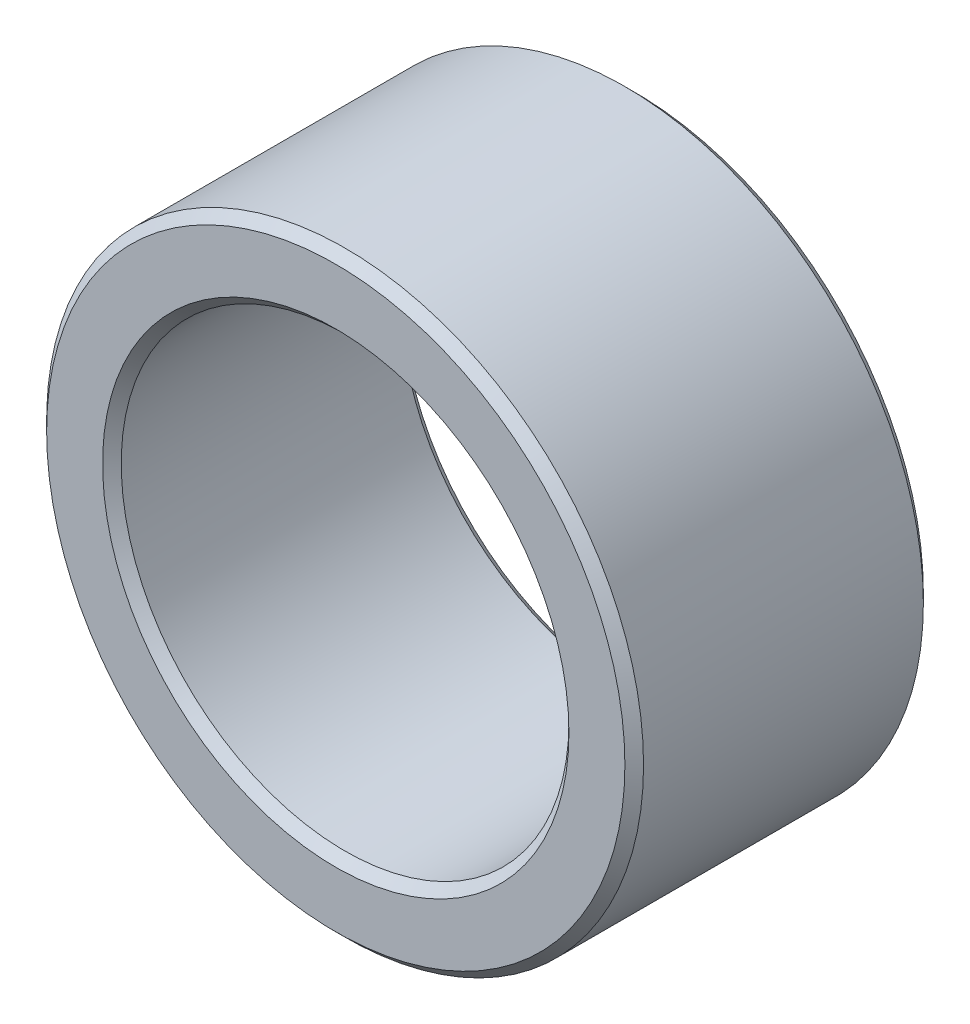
ISO-10303-21;
HEADER;
FILE_DESCRIPTION(('STEP AP214'),'2;1');
FILE_NAME('part.step','',(''),(''),'','','');
FILE_SCHEMA(('AUTOMOTIVE_DESIGN { 1 0 10303 214 1 1 1 1 }'));
ENDSEC;
DATA;
#1=APPLICATION_CONTEXT('core data for automotive mechanical design processes');
#2=APPLICATION_PROTOCOL_DEFINITION('international standard','automotive_design',2000,#1);
#3=PRODUCT_CONTEXT('',#1,'mechanical');
#4=PRODUCT('Part','Part','',(#3));
#5=PRODUCT_RELATED_PRODUCT_CATEGORY('part','',(#4));
#6=PRODUCT_DEFINITION_FORMATION('','',#4);
#7=PRODUCT_DEFINITION_CONTEXT('part definition',#1,'design');
#8=PRODUCT_DEFINITION('design','',#6,#7);
#9=PRODUCT_DEFINITION_SHAPE('','',#8);
#10=(LENGTH_UNIT() NAMED_UNIT(*) SI_UNIT(.MILLI.,.METRE.));
#11=(NAMED_UNIT(*) PLANE_ANGLE_UNIT() SI_UNIT($,.RADIAN.));
#12=(NAMED_UNIT(*) SI_UNIT($,.STERADIAN.) SOLID_ANGLE_UNIT());
#13=UNCERTAINTY_MEASURE_WITH_UNIT(LENGTH_MEASURE(1.E-05),#10,'distance_accuracy_value','');
#14=(GEOMETRIC_REPRESENTATION_CONTEXT(3) GLOBAL_UNCERTAINTY_ASSIGNED_CONTEXT((#13)) GLOBAL_UNIT_ASSIGNED_CONTEXT((#10,
#11,#12)) REPRESENTATION_CONTEXT('',''));
#15=CARTESIAN_POINT('',(0.,0.,0.));
#16=DIRECTION('',(0.,0.,1.));
#17=DIRECTION('',(1.,0.,0.));
#18=AXIS2_PLACEMENT_3D('',#15,#16,#17);
#19=CARTESIAN_POINT('',(0.,0.,16.));
#20=DIRECTION('',(0.,0.,1.));
#21=DIRECTION('',(1.,0.,0.));
#22=AXIS2_PLACEMENT_3D('',#19,#20,#21);
#23=PLANE('',#22);
#24=CARTESIAN_POINT('',(0.,0.,16.));
#25=DIRECTION('',(0.,0.,1.));
#26=DIRECTION('',(1.,0.,0.));
#27=AXIS2_PLACEMENT_3D('',#24,#25,#26);
#28=CIRCLE('',#27,12.5);
#29=CARTESIAN_POINT('',(12.5,0.,16.));
#30=VERTEX_POINT('',#29);
#31=EDGE_CURVE('E10',#30,#30,#28,.F.);
#32=ORIENTED_EDGE('',*,*,#31,.T.);
#33=EDGE_LOOP('',(#32));
#34=FACE_BOUND('',#33,.T.);
#35=CARTESIAN_POINT('',(0.,0.,16.));
#36=DIRECTION('',(0.,0.,1.));
#37=DIRECTION('',(1.,0.,0.));
#38=AXIS2_PLACEMENT_3D('',#35,#36,#37);
#39=CIRCLE('',#38,15.5);
#40=CARTESIAN_POINT('',(15.5,0.,16.));
#41=VERTEX_POINT('',#40);
#42=EDGE_CURVE('E35',#41,#41,#39,.T.);
#43=ORIENTED_EDGE('',*,*,#42,.T.);
#44=EDGE_LOOP('',(#43));
#45=FACE_BOUND('',#44,.T.);
#46=ADVANCED_FACE('F28',(#34,#45),#23,.T.);
#47=CARTESIAN_POINT('',(0.,0.,0.));
#48=DIRECTION('',(0.,0.,1.));
#49=DIRECTION('',(1.,0.,0.));
#50=AXIS2_PLACEMENT_3D('',#47,#48,#49);
#51=PLANE('',#50);
#52=CARTESIAN_POINT('',(0.,0.,0.));
#53=DIRECTION('',(0.,0.,1.));
#54=DIRECTION('',(1.,0.,0.));
#55=AXIS2_PLACEMENT_3D('',#52,#53,#54);
#56=CIRCLE('',#55,12.5);
#57=CARTESIAN_POINT('',(12.5,0.,0.));
#58=VERTEX_POINT('',#57);
#59=EDGE_CURVE('E54',#58,#58,#56,.T.);
#60=ORIENTED_EDGE('',*,*,#59,.T.);
#61=EDGE_LOOP('',(#60));
#62=FACE_BOUND('',#61,.T.);
#63=CARTESIAN_POINT('',(0.,0.,0.));
#64=DIRECTION('',(0.,0.,1.));
#65=DIRECTION('',(1.,0.,0.));
#66=AXIS2_PLACEMENT_3D('',#63,#64,#65);
#67=CIRCLE('',#66,15.5);
#68=CARTESIAN_POINT('',(15.5,0.,0.));
#69=VERTEX_POINT('',#68);
#70=EDGE_CURVE('E57',#69,#69,#67,.F.);
#71=ORIENTED_EDGE('',*,*,#70,.T.);
#72=EDGE_LOOP('',(#71));
#73=FACE_BOUND('',#72,.T.);
#74=ADVANCED_FACE('F61',(#62,#73),#51,.F.);
#75=CARTESIAN_POINT('',(0.,0.,16.));
#76=DIRECTION('',(0.,0.,-1.));
#77=DIRECTION('',(-1.,0.,0.));
#78=AXIS2_PLACEMENT_3D('',#75,#76,#77);
#79=CYLINDRICAL_SURFACE('',#78,16.);
#80=CARTESIAN_POINT('',(0.,0.,0.5));
#81=DIRECTION('',(0.,0.,1.));
#82=DIRECTION('',(1.,0.,0.));
#83=AXIS2_PLACEMENT_3D('',#80,#81,#82);
#84=CIRCLE('',#83,16.);
#85=CARTESIAN_POINT('',(16.,0.,0.5));
#86=VERTEX_POINT('',#85);
#87=EDGE_CURVE('E39',#86,#86,#84,.T.);
#88=ORIENTED_EDGE('',*,*,#87,.T.);
#89=EDGE_LOOP('',(#88));
#90=FACE_BOUND('',#89,.T.);
#91=CARTESIAN_POINT('',(0.,0.,15.5));
#92=DIRECTION('',(0.,0.,1.));
#93=DIRECTION('',(1.,0.,0.));
#94=AXIS2_PLACEMENT_3D('',#91,#92,#93);
#95=CIRCLE('',#94,16.);
#96=CARTESIAN_POINT('',(16.,0.,15.5));
#97=VERTEX_POINT('',#96);
#98=EDGE_CURVE('E43',#97,#97,#95,.F.);
#99=ORIENTED_EDGE('',*,*,#98,.T.);
#100=EDGE_LOOP('',(#99));
#101=FACE_BOUND('',#100,.T.);
#102=ADVANCED_FACE('F30',(#90,#101),#79,.T.);
#103=CARTESIAN_POINT('',(0.,0.,16.));
#104=DIRECTION('',(0.,0.,-1.));
#105=DIRECTION('',(-1.,0.,0.));
#106=AXIS2_PLACEMENT_3D('',#103,#104,#105);
#107=CYLINDRICAL_SURFACE('',#106,12.);
#108=CARTESIAN_POINT('',(0.,0.,0.500000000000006));
#109=DIRECTION('',(0.,0.,1.));
#110=DIRECTION('',(1.,0.,0.));
#111=AXIS2_PLACEMENT_3D('',#108,#109,#110);
#112=CIRCLE('',#111,12.);
#113=CARTESIAN_POINT('',(12.,0.,0.500000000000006));
#114=VERTEX_POINT('',#113);
#115=EDGE_CURVE('E48',#114,#114,#112,.F.);
#116=ORIENTED_EDGE('',*,*,#115,.T.);
#117=EDGE_LOOP('',(#116));
#118=FACE_BOUND('',#117,.T.);
#119=CARTESIAN_POINT('',(0.,0.,15.5));
#120=DIRECTION('',(0.,0.,1.));
#121=DIRECTION('',(1.,0.,0.));
#122=AXIS2_PLACEMENT_3D('',#119,#120,#121);
#123=CIRCLE('',#122,12.);
#124=CARTESIAN_POINT('',(12.,0.,15.5));
#125=VERTEX_POINT('',#124);
#126=EDGE_CURVE('E51',#125,#125,#123,.T.);
#127=ORIENTED_EDGE('',*,*,#126,.T.);
#128=EDGE_LOOP('',(#127));
#129=FACE_BOUND('',#128,.T.);
#130=ADVANCED_FACE('F73',(#118,#129),#107,.F.);
#131=CARTESIAN_POINT('',(0.,0.,0.));
#132=DIRECTION('',(0.,0.,-1.));
#133=DIRECTION('',(-1.,0.,0.));
#134=AXIS2_PLACEMENT_3D('',#131,#132,#133);
#135=CONICAL_SURFACE('',#134,12.5,0.785398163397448);
#136=ORIENTED_EDGE('',*,*,#115,.F.);
#137=EDGE_LOOP('',(#136));
#138=FACE_BOUND('',#137,.T.);
#139=ORIENTED_EDGE('',*,*,#59,.F.);
#140=EDGE_LOOP('',(#139));
#141=FACE_BOUND('',#140,.T.);
#142=ADVANCED_FACE('F67',(#138,#141),#135,.F.);
#143=CARTESIAN_POINT('',(0.,0.,0.5));
#144=DIRECTION('',(0.,0.,1.));
#145=DIRECTION('',(1.,0.,0.));
#146=AXIS2_PLACEMENT_3D('',#143,#144,#145);
#147=CONICAL_SURFACE('',#146,16.,0.785398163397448);
#148=ORIENTED_EDGE('',*,*,#70,.F.);
#149=EDGE_LOOP('',(#148));
#150=FACE_BOUND('',#149,.T.);
#151=ORIENTED_EDGE('',*,*,#87,.F.);
#152=EDGE_LOOP('',(#151));
#153=FACE_BOUND('',#152,.T.);
#154=ADVANCED_FACE('F63',(#150,#153),#147,.T.);
#155=CARTESIAN_POINT('',(0.,0.,15.5));
#156=DIRECTION('',(0.,0.,1.));
#157=DIRECTION('',(1.,0.,0.));
#158=AXIS2_PLACEMENT_3D('',#155,#156,#157);
#159=CONICAL_SURFACE('',#158,12.,0.78539816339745);
#160=ORIENTED_EDGE('',*,*,#31,.F.);
#161=EDGE_LOOP('',(#160));
#162=FACE_BOUND('',#161,.T.);
#163=ORIENTED_EDGE('',*,*,#126,.F.);
#164=EDGE_LOOP('',(#163));
#165=FACE_BOUND('',#164,.T.);
#166=ADVANCED_FACE('F66',(#162,#165),#159,.F.);
#167=CARTESIAN_POINT('',(0.,0.,16.));
#168=DIRECTION('',(0.,0.,-1.));
#169=DIRECTION('',(-1.,0.,0.));
#170=AXIS2_PLACEMENT_3D('',#167,#168,#169);
#171=CONICAL_SURFACE('',#170,15.5,0.785398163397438);
#172=ORIENTED_EDGE('',*,*,#98,.F.);
#173=EDGE_LOOP('',(#172));
#174=FACE_BOUND('',#173,.T.);
#175=ORIENTED_EDGE('',*,*,#42,.F.);
#176=EDGE_LOOP('',(#175));
#177=FACE_BOUND('',#176,.T.);
#178=ADVANCED_FACE('F76',(#174,#177),#171,.T.);
#179=CLOSED_SHELL('',(#46,#74,#102,#130,#142,#154,#166,#178));
#180=MANIFOLD_SOLID_BREP('B2',#179);
#181=ADVANCED_BREP_SHAPE_REPRESENTATION('',(#18,#180),#14);
#182=SHAPE_DEFINITION_REPRESENTATION(#9,#181);
ENDSEC;
END-ISO-10303-21;
